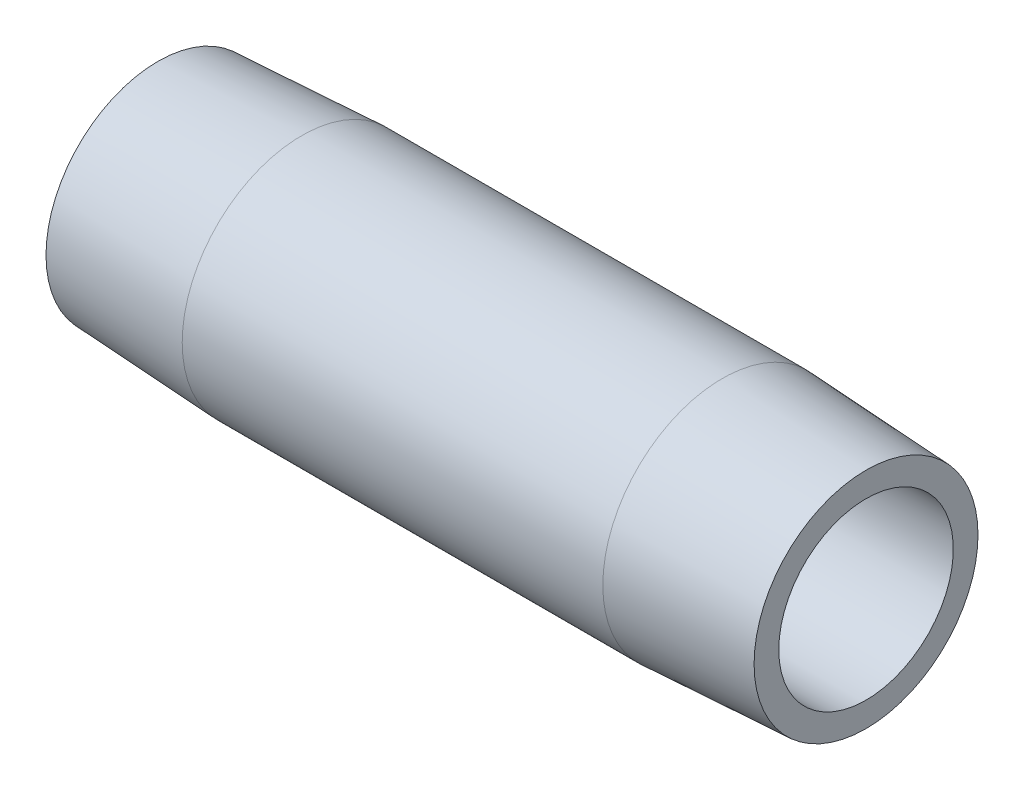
ISO-10303-21;
HEADER;
FILE_DESCRIPTION(('STEP AP214'),'2;1');
FILE_NAME('part.step','',(''),(''),'','','');
FILE_SCHEMA(('AUTOMOTIVE_DESIGN { 1 0 10303 214 1 1 1 1 }'));
ENDSEC;
DATA;
#1=APPLICATION_CONTEXT('core data for automotive mechanical design processes');
#2=APPLICATION_PROTOCOL_DEFINITION('international standard','automotive_design',2000,#1);
#3=PRODUCT_CONTEXT('',#1,'mechanical');
#4=PRODUCT('Part','Part','',(#3));
#5=PRODUCT_RELATED_PRODUCT_CATEGORY('part','',(#4));
#6=PRODUCT_DEFINITION_FORMATION('','',#4);
#7=PRODUCT_DEFINITION_CONTEXT('part definition',#1,'design');
#8=PRODUCT_DEFINITION('design','',#6,#7);
#9=PRODUCT_DEFINITION_SHAPE('','',#8);
#10=(LENGTH_UNIT() NAMED_UNIT(*) SI_UNIT(.MILLI.,.METRE.));
#11=(NAMED_UNIT(*) PLANE_ANGLE_UNIT() SI_UNIT($,.RADIAN.));
#12=(NAMED_UNIT(*) SI_UNIT($,.STERADIAN.) SOLID_ANGLE_UNIT());
#13=UNCERTAINTY_MEASURE_WITH_UNIT(LENGTH_MEASURE(1.E-05),#10,'distance_accuracy_value','');
#14=(GEOMETRIC_REPRESENTATION_CONTEXT(3) GLOBAL_UNCERTAINTY_ASSIGNED_CONTEXT((#13)) GLOBAL_UNIT_ASSIGNED_CONTEXT((#10,
#11,#12)) REPRESENTATION_CONTEXT('',''));
#15=CARTESIAN_POINT('',(0.,0.,0.));
#16=DIRECTION('',(0.,0.,1.));
#17=DIRECTION('',(1.,0.,0.));
#18=AXIS2_PLACEMENT_3D('',#15,#16,#17);
#19=CARTESIAN_POINT('',(50.8,6.26110000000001,0.));
#20=DIRECTION('',(-1.,0.,0.));
#21=DIRECTION('',(0.,0.,1.));
#22=AXIS2_PLACEMENT_3D('',#19,#20,#21);
#23=PLANE('',#22);
#24=CARTESIAN_POINT('',(50.8,0.,0.));
#25=DIRECTION('',(-1.,0.,0.));
#26=DIRECTION('',(0.,0.,1.));
#27=AXIS2_PLACEMENT_3D('',#24,#25,#26);
#28=CIRCLE('',#27,8.03205001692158);
#29=CARTESIAN_POINT('',(50.8,0.,8.03205001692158));
#30=VERTEX_POINT('',#29);
#31=EDGE_CURVE('E10',#30,#30,#28,.T.);
#32=ORIENTED_EDGE('',*,*,#31,.F.);
#33=EDGE_LOOP('',(#32));
#34=FACE_BOUND('',#33,.T.);
#35=CARTESIAN_POINT('',(50.8,0.,0.));
#36=DIRECTION('',(-1.,0.,0.));
#37=DIRECTION('',(0.,0.,1.));
#38=AXIS2_PLACEMENT_3D('',#35,#36,#37);
#39=CIRCLE('',#38,6.26110000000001);
#40=CARTESIAN_POINT('',(50.8,0.,6.26110000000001));
#41=VERTEX_POINT('',#40);
#42=EDGE_CURVE('E52',#41,#41,#39,.T.);
#43=ORIENTED_EDGE('',*,*,#42,.T.);
#44=EDGE_LOOP('',(#43));
#45=FACE_BOUND('',#44,.T.);
#46=ADVANCED_FACE('F30',(#34,#45),#23,.F.);
#47=CARTESIAN_POINT('',(50.8,0.,0.));
#48=DIRECTION('',(-1.,0.,0.));
#49=DIRECTION('',(0.,0.,1.));
#50=AXIS2_PLACEMENT_3D('',#47,#48,#49);
#51=CONICAL_SURFACE('',#50,8.03205001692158,0.0523598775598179);
#52=CARTESIAN_POINT('',(40.4876,0.,0.));
#53=DIRECTION('',(-1.,0.,0.));
#54=DIRECTION('',(0.,0.,1.));
#55=AXIS2_PLACEMENT_3D('',#52,#53,#54);
#56=CIRCLE('',#55,8.57249999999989);
#57=CARTESIAN_POINT('',(40.4876,0.,8.57249999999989));
#58=VERTEX_POINT('',#57);
#59=EDGE_CURVE('E36',#58,#58,#56,.T.);
#60=ORIENTED_EDGE('',*,*,#59,.F.);
#61=EDGE_LOOP('',(#60));
#62=FACE_BOUND('',#61,.T.);
#63=ORIENTED_EDGE('',*,*,#31,.T.);
#64=EDGE_LOOP('',(#63));
#65=FACE_BOUND('',#64,.T.);
#66=ADVANCED_FACE('F77',(#62,#65),#51,.T.);
#67=CARTESIAN_POINT('',(0.,0.,0.));
#68=DIRECTION('',(-1.,0.,0.));
#69=DIRECTION('',(0.,0.,1.));
#70=AXIS2_PLACEMENT_3D('',#67,#68,#69);
#71=CYLINDRICAL_SURFACE('',#70,8.57249999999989);
#72=CARTESIAN_POINT('',(10.3124,0.,0.));
#73=DIRECTION('',(-1.,0.,0.));
#74=DIRECTION('',(0.,0.,1.));
#75=AXIS2_PLACEMENT_3D('',#72,#73,#74);
#76=CIRCLE('',#75,8.57249999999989);
#77=CARTESIAN_POINT('',(10.3124,0.,8.57249999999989));
#78=VERTEX_POINT('',#77);
#79=EDGE_CURVE('E40',#78,#78,#76,.T.);
#80=ORIENTED_EDGE('',*,*,#79,.F.);
#81=EDGE_LOOP('',(#80));
#82=FACE_BOUND('',#81,.T.);
#83=ORIENTED_EDGE('',*,*,#59,.T.);
#84=EDGE_LOOP('',(#83));
#85=FACE_BOUND('',#84,.T.);
#86=ADVANCED_FACE('F72',(#82,#85),#71,.T.);
#87=CARTESIAN_POINT('',(10.3124,0.,0.));
#88=DIRECTION('',(1.,0.,0.));
#89=DIRECTION('',(0.,0.,-1.));
#90=AXIS2_PLACEMENT_3D('',#87,#88,#89);
#91=CONICAL_SURFACE('',#90,8.57249999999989,0.0523598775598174);
#92=CARTESIAN_POINT('',(0.,0.,0.));
#93=DIRECTION('',(-1.,0.,0.));
#94=DIRECTION('',(0.,0.,1.));
#95=AXIS2_PLACEMENT_3D('',#92,#93,#94);
#96=CIRCLE('',#95,8.03205001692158);
#97=CARTESIAN_POINT('',(0.,0.,8.03205001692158));
#98=VERTEX_POINT('',#97);
#99=EDGE_CURVE('E44',#98,#98,#96,.T.);
#100=ORIENTED_EDGE('',*,*,#99,.F.);
#101=EDGE_LOOP('',(#100));
#102=FACE_BOUND('',#101,.T.);
#103=ORIENTED_EDGE('',*,*,#79,.T.);
#104=EDGE_LOOP('',(#103));
#105=FACE_BOUND('',#104,.T.);
#106=ADVANCED_FACE('F66',(#102,#105),#91,.T.);
#107=CARTESIAN_POINT('',(0.,6.26110000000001,0.));
#108=DIRECTION('',(1.,0.,0.));
#109=DIRECTION('',(0.,0.,-1.));
#110=AXIS2_PLACEMENT_3D('',#107,#108,#109);
#111=PLANE('',#110);
#112=CARTESIAN_POINT('',(0.,0.,0.));
#113=DIRECTION('',(-1.,0.,0.));
#114=DIRECTION('',(0.,0.,1.));
#115=AXIS2_PLACEMENT_3D('',#112,#113,#114);
#116=CIRCLE('',#115,6.26110000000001);
#117=CARTESIAN_POINT('',(0.,0.,6.26110000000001));
#118=VERTEX_POINT('',#117);
#119=EDGE_CURVE('E49',#118,#118,#116,.T.);
#120=ORIENTED_EDGE('',*,*,#119,.F.);
#121=EDGE_LOOP('',(#120));
#122=FACE_BOUND('',#121,.T.);
#123=ORIENTED_EDGE('',*,*,#99,.T.);
#124=EDGE_LOOP('',(#123));
#125=FACE_BOUND('',#124,.T.);
#126=ADVANCED_FACE('F60',(#122,#125),#111,.F.);
#127=CARTESIAN_POINT('',(0.,0.,0.));
#128=DIRECTION('',(-1.,0.,0.));
#129=DIRECTION('',(0.,0.,1.));
#130=AXIS2_PLACEMENT_3D('',#127,#128,#129);
#131=CYLINDRICAL_SURFACE('',#130,6.26110000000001);
#132=ORIENTED_EDGE('',*,*,#42,.F.);
#133=EDGE_LOOP('',(#132));
#134=FACE_BOUND('',#133,.T.);
#135=ORIENTED_EDGE('',*,*,#119,.T.);
#136=EDGE_LOOP('',(#135));
#137=FACE_BOUND('',#136,.T.);
#138=ADVANCED_FACE('F57',(#134,#137),#131,.F.);
#139=CLOSED_SHELL('',(#46,#66,#86,#106,#126,#138));
#140=MANIFOLD_SOLID_BREP('B2',#139);
#141=ADVANCED_BREP_SHAPE_REPRESENTATION('',(#18,#140),#14);
#142=SHAPE_DEFINITION_REPRESENTATION(#9,#141);
ENDSEC;
END-ISO-10303-21;
